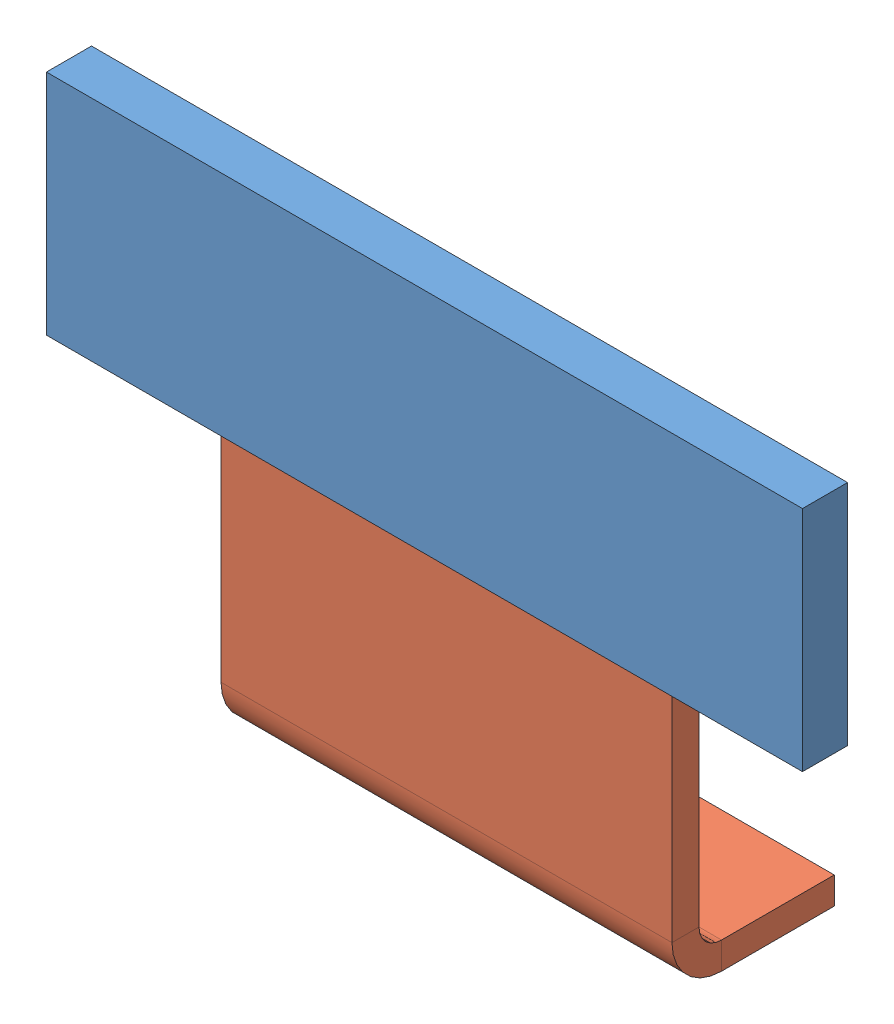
SolidWorks assembly Baugruppe1.SLDASM, configuration Standard (file format 4700). Lengths in mm.
Overall size (167.68 118.85 46).
2 component instances, 2 part files, 1 mates.
Components (placement in the parent):
- Teil1-1: Teil1.SLDPRT [Standard] at origin size (167.68 50.54 10)
- YX1432~c-1: YX1432~c.SLDPRT [Standard] at (-5.1166 -93.5768 0) x (0 0 -1) z (1 0 0) size (36 100 100)
Mates (geometry in assembly coordinates):
- Deckungsgleich1: coincident anti-aligned: plane of Teil1-1 through (83.8403 25.2687 0) normal (0 0 -1); plane of YX1432~c-1 through (44.8834 -93.5768 0) normal (0 0 1)
